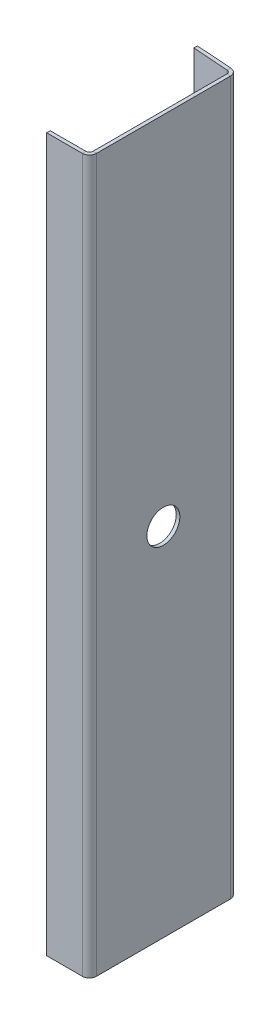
ISO-10303-21;
HEADER;
FILE_DESCRIPTION(('STEP AP214'),'2;1');
FILE_NAME('part.step','',(''),(''),'','','');
FILE_SCHEMA(('AUTOMOTIVE_DESIGN { 1 0 10303 214 1 1 1 1 }'));
ENDSEC;
DATA;
#1=APPLICATION_CONTEXT('core data for automotive mechanical design processes');
#2=APPLICATION_PROTOCOL_DEFINITION('international standard','automotive_design',2000,#1);
#3=PRODUCT_CONTEXT('',#1,'mechanical');
#4=PRODUCT('Part','Part','',(#3));
#5=PRODUCT_RELATED_PRODUCT_CATEGORY('part','',(#4));
#6=PRODUCT_DEFINITION_FORMATION('','',#4);
#7=PRODUCT_DEFINITION_CONTEXT('part definition',#1,'design');
#8=PRODUCT_DEFINITION('design','',#6,#7);
#9=PRODUCT_DEFINITION_SHAPE('','',#8);
#10=(LENGTH_UNIT() NAMED_UNIT(*) SI_UNIT(.MILLI.,.METRE.));
#11=(NAMED_UNIT(*) PLANE_ANGLE_UNIT() SI_UNIT($,.RADIAN.));
#12=(NAMED_UNIT(*) SI_UNIT($,.STERADIAN.) SOLID_ANGLE_UNIT());
#13=UNCERTAINTY_MEASURE_WITH_UNIT(LENGTH_MEASURE(1.E-05),#10,'distance_accuracy_value','');
#14=(GEOMETRIC_REPRESENTATION_CONTEXT(3) GLOBAL_UNCERTAINTY_ASSIGNED_CONTEXT((#13)) GLOBAL_UNIT_ASSIGNED_CONTEXT((#10,
#11,#12)) REPRESENTATION_CONTEXT('',''));
#15=CARTESIAN_POINT('',(0.,0.,0.));
#16=DIRECTION('',(0.,0.,1.));
#17=DIRECTION('',(1.,0.,0.));
#18=AXIS2_PLACEMENT_3D('',#15,#16,#17);
#19=CARTESIAN_POINT('',(0.,1270.,-6.35));
#20=DIRECTION('',(0.,1.,0.));
#21=DIRECTION('',(0.,0.,1.));
#22=AXIS2_PLACEMENT_3D('',#19,#20,#21);
#23=PLANE('',#22);
#24=DIRECTION('',(1.,0.,0.));
#25=VECTOR('',#24,1.);
#26=CARTESIAN_POINT('',(0.,1270.,-6.35));
#27=LINE('',#26,#25);
#28=CARTESIAN_POINT('',(0.,1270.,-6.35));
#29=VERTEX_POINT('',#28);
#30=CARTESIAN_POINT('',(6.35,1270.,-6.35));
#31=VERTEX_POINT('',#30);
#32=EDGE_CURVE('E11',#29,#31,#27,.T.);
#33=ORIENTED_EDGE('',*,*,#32,.F.);
#34=CARTESIAN_POINT('',(-6.35,1270.,-6.35));
#35=DIRECTION('',(0.,-1.,0.));
#36=DIRECTION('',(0.,0.,-1.));
#37=AXIS2_PLACEMENT_3D('',#34,#35,#36);
#38=CIRCLE('',#37,6.35);
#39=CARTESIAN_POINT('',(-6.34999999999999,1270.,0.));
#40=VERTEX_POINT('',#39);
#41=EDGE_CURVE('E249',#40,#29,#38,.F.);
#42=ORIENTED_EDGE('',*,*,#41,.F.);
#43=DIRECTION('',(0.,0.,-1.));
#44=VECTOR('',#43,1.);
#45=CARTESIAN_POINT('',(-6.35,1270.,6.35));
#46=LINE('',#45,#44);
#47=CARTESIAN_POINT('',(-6.35,1270.,6.35));
#48=VERTEX_POINT('',#47);
#49=EDGE_CURVE('E46',#48,#40,#46,.T.);
#50=ORIENTED_EDGE('',*,*,#49,.F.);
#51=CARTESIAN_POINT('',(-6.35,1270.,-6.35));
#52=DIRECTION('',(0.,1.,0.));
#53=DIRECTION('',(1.,0.,0.));
#54=AXIS2_PLACEMENT_3D('',#51,#52,#53);
#55=CIRCLE('',#54,12.7);
#56=EDGE_CURVE('E147',#48,#31,#55,.T.);
#57=ORIENTED_EDGE('',*,*,#56,.T.);
#58=EDGE_LOOP('',(#33,#42,#50,#57));
#59=FACE_BOUND('',#58,.T.);
#60=ADVANCED_FACE('F38',(#59),#23,.T.);
#61=CARTESIAN_POINT('',(-6.35,1270.,6.35));
#62=DIRECTION('',(0.,1.,0.));
#63=DIRECTION('',(0.,0.,1.));
#64=AXIS2_PLACEMENT_3D('',#61,#62,#63);
#65=PLANE('',#64);
#66=DIRECTION('',(0.,0.,-1.));
#67=VECTOR('',#66,1.);
#68=CARTESIAN_POINT('',(0.,1270.,0.));
#69=LINE('',#68,#67);
#70=CARTESIAN_POINT('',(0.,1270.,-244.903529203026));
#71=VERTEX_POINT('',#70);
#72=EDGE_CURVE('E141',#29,#71,#69,.T.);
#73=ORIENTED_EDGE('',*,*,#72,.F.);
#74=ORIENTED_EDGE('',*,*,#32,.T.);
#75=DIRECTION('',(0.,0.,-1.));
#76=VECTOR('',#75,1.);
#77=CARTESIAN_POINT('',(6.35,1270.,0.));
#78=LINE('',#77,#76);
#79=CARTESIAN_POINT('',(6.35,1270.,-244.903529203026));
#80=VERTEX_POINT('',#79);
#81=EDGE_CURVE('E138',#31,#80,#78,.T.);
#82=ORIENTED_EDGE('',*,*,#81,.T.);
#83=DIRECTION('',(-1.,0.,0.));
#84=VECTOR('',#83,1.);
#85=CARTESIAN_POINT('',(6.35,1270.,-244.903529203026));
#86=LINE('',#85,#84);
#87=EDGE_CURVE('E230',#80,#71,#86,.T.);
#88=ORIENTED_EDGE('',*,*,#87,.T.);
#89=EDGE_LOOP('',(#73,#74,#82,#88));
#90=FACE_BOUND('',#89,.T.);
#91=ADVANCED_FACE('F136',(#90),#65,.T.);
#92=CARTESIAN_POINT('',(-6.34999999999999,0.,0.));
#93=DIRECTION('',(0.,-1.,0.));
#94=DIRECTION('',(0.,0.,-1.));
#95=AXIS2_PLACEMENT_3D('',#92,#93,#94);
#96=PLANE('',#95);
#97=DIRECTION('',(0.,0.,1.));
#98=VECTOR('',#97,1.);
#99=CARTESIAN_POINT('',(-6.34999999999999,0.,0.));
#100=LINE('',#99,#98);
#101=CARTESIAN_POINT('',(-6.34999999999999,0.,0.));
#102=VERTEX_POINT('',#101);
#103=CARTESIAN_POINT('',(-6.35,0.,6.35));
#104=VERTEX_POINT('',#103);
#105=EDGE_CURVE('E235',#102,#104,#100,.T.);
#106=ORIENTED_EDGE('',*,*,#105,.F.);
#107=CARTESIAN_POINT('',(-6.35,0.,-6.35));
#108=DIRECTION('',(0.,-1.,0.));
#109=DIRECTION('',(0.,0.,-1.));
#110=AXIS2_PLACEMENT_3D('',#107,#108,#109);
#111=CIRCLE('',#110,6.35);
#112=CARTESIAN_POINT('',(0.,0.,-6.35));
#113=VERTEX_POINT('',#112);
#114=EDGE_CURVE('E187',#102,#113,#111,.F.);
#115=ORIENTED_EDGE('',*,*,#114,.T.);
#116=DIRECTION('',(-1.,0.,0.));
#117=VECTOR('',#116,1.);
#118=CARTESIAN_POINT('',(6.35,0.,-6.35));
#119=LINE('',#118,#117);
#120=CARTESIAN_POINT('',(6.35,0.,-6.35));
#121=VERTEX_POINT('',#120);
#122=EDGE_CURVE('E233',#121,#113,#119,.T.);
#123=ORIENTED_EDGE('',*,*,#122,.F.);
#124=CARTESIAN_POINT('',(-6.35,0.,-6.35));
#125=DIRECTION('',(0.,1.,0.));
#126=DIRECTION('',(1.,0.,0.));
#127=AXIS2_PLACEMENT_3D('',#124,#125,#126);
#128=CIRCLE('',#127,12.7);
#129=EDGE_CURVE('E159',#104,#121,#128,.T.);
#130=ORIENTED_EDGE('',*,*,#129,.F.);
#131=EDGE_LOOP('',(#106,#115,#123,#130));
#132=FACE_BOUND('',#131,.T.);
#133=ADVANCED_FACE('F292',(#132),#96,.T.);
#134=CARTESIAN_POINT('',(6.35,0.,-6.35));
#135=DIRECTION('',(0.,-1.,0.));
#136=DIRECTION('',(0.,0.,-1.));
#137=AXIS2_PLACEMENT_3D('',#134,#135,#136);
#138=PLANE('',#137);
#139=DIRECTION('',(1.,0.,0.));
#140=VECTOR('',#139,1.);
#141=CARTESIAN_POINT('',(-69.85,0.,0.));
#142=LINE('',#141,#140);
#143=CARTESIAN_POINT('',(-69.85,0.,0.));
#144=VERTEX_POINT('',#143);
#145=EDGE_CURVE('E190',#144,#102,#142,.T.);
#146=ORIENTED_EDGE('',*,*,#145,.T.);
#147=ORIENTED_EDGE('',*,*,#105,.T.);
#148=DIRECTION('',(1.,0.,0.));
#149=VECTOR('',#148,1.);
#150=CARTESIAN_POINT('',(-69.85,0.,6.35));
#151=LINE('',#150,#149);
#152=CARTESIAN_POINT('',(-69.85,0.,6.35));
#153=VERTEX_POINT('',#152);
#154=EDGE_CURVE('E196',#153,#104,#151,.T.);
#155=ORIENTED_EDGE('',*,*,#154,.F.);
#156=DIRECTION('',(0.,0.,-1.));
#157=VECTOR('',#156,1.);
#158=CARTESIAN_POINT('',(-69.85,0.,6.35));
#159=LINE('',#158,#157);
#160=EDGE_CURVE('E193',#153,#144,#159,.T.);
#161=ORIENTED_EDGE('',*,*,#160,.T.);
#162=EDGE_LOOP('',(#146,#147,#155,#161));
#163=FACE_BOUND('',#162,.T.);
#164=ADVANCED_FACE('F296',(#163),#138,.T.);
#165=CARTESIAN_POINT('',(-5.90704639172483,1270.,-251.238060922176));
#166=DIRECTION('',(0.,1.,0.));
#167=DIRECTION('',(0.,0.,1.));
#168=AXIS2_PLACEMENT_3D('',#165,#166,#167);
#169=PLANE('',#168);
#170=DIRECTION('',(0.0697564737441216,0.,-0.997564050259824));
#171=VECTOR('',#170,1.);
#172=CARTESIAN_POINT('',(-5.90704639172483,1270.,-251.238060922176));
#173=LINE('',#172,#171);
#174=CARTESIAN_POINT('',(-5.90704639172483,1270.,-251.238060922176));
#175=VERTEX_POINT('',#174);
#176=CARTESIAN_POINT('',(-5.46409278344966,1270.,-257.572592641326));
#177=VERTEX_POINT('',#176);
#178=EDGE_CURVE('E54',#175,#177,#173,.T.);
#179=ORIENTED_EDGE('',*,*,#178,.F.);
#180=CARTESIAN_POINT('',(-6.35,1270.,-244.903529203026));
#181=DIRECTION('',(0.,-1.,0.));
#182=DIRECTION('',(0.,0.,-1.));
#183=AXIS2_PLACEMENT_3D('',#180,#181,#182);
#184=CIRCLE('',#183,6.35);
#185=EDGE_CURVE('E259',#71,#175,#184,.F.);
#186=ORIENTED_EDGE('',*,*,#185,.F.);
#187=ORIENTED_EDGE('',*,*,#87,.F.);
#188=CARTESIAN_POINT('',(-6.35,1270.,-244.903529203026));
#189=DIRECTION('',(0.,1.,0.));
#190=DIRECTION('',(1.,0.,0.));
#191=AXIS2_PLACEMENT_3D('',#188,#189,#190);
#192=CIRCLE('',#191,12.7);
#193=EDGE_CURVE('E167',#80,#177,#192,.T.);
#194=ORIENTED_EDGE('',*,*,#193,.T.);
#195=EDGE_LOOP('',(#179,#186,#187,#194));
#196=FACE_BOUND('',#195,.T.);
#197=ADVANCED_FACE('F302',(#196),#169,.T.);
#198=CARTESIAN_POINT('',(6.35,1270.,-244.903529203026));
#199=DIRECTION('',(0.,1.,0.));
#200=DIRECTION('',(0.,0.,1.));
#201=AXIS2_PLACEMENT_3D('',#198,#199,#200);
#202=PLANE('',#201);
#203=DIRECTION('',(-0.997564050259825,0.,-0.0697564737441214));
#204=VECTOR('',#203,1.);
#205=CARTESIAN_POINT('',(0.,1270.,-250.825));
#206=LINE('',#205,#204);
#207=CARTESIAN_POINT('',(-69.6798489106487,1270.,-255.697489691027));
#208=VERTEX_POINT('',#207);
#209=EDGE_CURVE('E262',#175,#208,#206,.T.);
#210=ORIENTED_EDGE('',*,*,#209,.F.);
#211=ORIENTED_EDGE('',*,*,#178,.T.);
#212=DIRECTION('',(-0.997564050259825,0.,-0.0697564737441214));
#213=VECTOR('',#212,1.);
#214=CARTESIAN_POINT('',(0.442953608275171,1270.,-257.15953171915));
#215=LINE('',#214,#213);
#216=CARTESIAN_POINT('',(-69.2368953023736,1270.,-262.032021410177));
#217=VERTEX_POINT('',#216);
#218=EDGE_CURVE('E108',#177,#217,#215,.T.);
#219=ORIENTED_EDGE('',*,*,#218,.T.);
#220=DIRECTION('',(0.0697564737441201,0.,-0.997564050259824));
#221=VECTOR('',#220,1.);
#222=CARTESIAN_POINT('',(-69.6798489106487,1270.,-255.697489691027));
#223=LINE('',#222,#221);
#224=EDGE_CURVE('E265',#208,#217,#223,.T.);
#225=ORIENTED_EDGE('',*,*,#224,.F.);
#226=EDGE_LOOP('',(#210,#211,#219,#225));
#227=FACE_BOUND('',#226,.T.);
#228=ADVANCED_FACE('F306',(#227),#202,.T.);
#229=CARTESIAN_POINT('',(0.,0.,-244.903529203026));
#230=DIRECTION('',(0.,-1.,0.));
#231=DIRECTION('',(0.,0.,-1.));
#232=AXIS2_PLACEMENT_3D('',#229,#230,#231);
#233=PLANE('',#232);
#234=DIRECTION('',(1.,0.,0.));
#235=VECTOR('',#234,1.);
#236=CARTESIAN_POINT('',(0.,0.,-244.903529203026));
#237=LINE('',#236,#235);
#238=CARTESIAN_POINT('',(0.,0.,-244.903529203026));
#239=VERTEX_POINT('',#238);
#240=CARTESIAN_POINT('',(6.35,0.,-244.903529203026));
#241=VERTEX_POINT('',#240);
#242=EDGE_CURVE('E95',#239,#241,#237,.T.);
#243=ORIENTED_EDGE('',*,*,#242,.F.);
#244=CARTESIAN_POINT('',(-6.35,0.,-244.903529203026));
#245=DIRECTION('',(0.,-1.,0.));
#246=DIRECTION('',(0.,0.,-1.));
#247=AXIS2_PLACEMENT_3D('',#244,#245,#246);
#248=CIRCLE('',#247,6.35);
#249=CARTESIAN_POINT('',(-5.90704639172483,0.,-251.238060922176));
#250=VERTEX_POINT('',#249);
#251=EDGE_CURVE('E183',#239,#250,#248,.F.);
#252=ORIENTED_EDGE('',*,*,#251,.T.);
#253=DIRECTION('',(-0.0697564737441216,0.,0.997564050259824));
#254=VECTOR('',#253,1.);
#255=CARTESIAN_POINT('',(-5.46409278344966,0.,-257.572592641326));
#256=LINE('',#255,#254);
#257=CARTESIAN_POINT('',(-5.46409278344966,0.,-257.572592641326));
#258=VERTEX_POINT('',#257);
#259=EDGE_CURVE('E102',#258,#250,#256,.T.);
#260=ORIENTED_EDGE('',*,*,#259,.F.);
#261=CARTESIAN_POINT('',(-6.35,0.,-244.903529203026));
#262=DIRECTION('',(0.,1.,0.));
#263=DIRECTION('',(1.,0.,0.));
#264=AXIS2_PLACEMENT_3D('',#261,#262,#263);
#265=CIRCLE('',#264,12.7);
#266=EDGE_CURVE('E202',#241,#258,#265,.T.);
#267=ORIENTED_EDGE('',*,*,#266,.F.);
#268=EDGE_LOOP('',(#243,#252,#260,#267));
#269=FACE_BOUND('',#268,.T.);
#270=ADVANCED_FACE('F310',(#269),#233,.T.);
#271=CARTESIAN_POINT('',(-5.46409278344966,0.,-257.572592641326));
#272=DIRECTION('',(0.,-1.,0.));
#273=DIRECTION('',(0.,0.,-1.));
#274=AXIS2_PLACEMENT_3D('',#271,#272,#273);
#275=PLANE('',#274);
#276=DIRECTION('',(0.,0.,-1.));
#277=VECTOR('',#276,1.);
#278=CARTESIAN_POINT('',(0.,0.,0.));
#279=LINE('',#278,#277);
#280=EDGE_CURVE('E185',#113,#239,#279,.T.);
#281=ORIENTED_EDGE('',*,*,#280,.T.);
#282=ORIENTED_EDGE('',*,*,#242,.T.);
#283=DIRECTION('',(0.,0.,-1.));
#284=VECTOR('',#283,1.);
#285=CARTESIAN_POINT('',(6.35,0.,0.));
#286=LINE('',#285,#284);
#287=EDGE_CURVE('E200',#121,#241,#286,.T.);
#288=ORIENTED_EDGE('',*,*,#287,.F.);
#289=ORIENTED_EDGE('',*,*,#122,.T.);
#290=EDGE_LOOP('',(#281,#282,#288,#289));
#291=FACE_BOUND('',#290,.T.);
#292=ADVANCED_FACE('F313',(#291),#275,.T.);
#293=CARTESIAN_POINT('',(0.442953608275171,1270.,-257.15953171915));
#294=DIRECTION('',(-0.0697564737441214,0.,0.997564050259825));
#295=DIRECTION('',(0.997564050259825,0.,0.0697564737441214));
#296=AXIS2_PLACEMENT_3D('',#293,#294,#295);
#297=PLANE('',#296);
#298=DIRECTION('',(-0.997564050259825,0.,-0.0697564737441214));
#299=VECTOR('',#298,1.);
#300=CARTESIAN_POINT('',(0.442953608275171,0.,-257.15953171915));
#301=LINE('',#300,#299);
#302=CARTESIAN_POINT('',(-69.2368953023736,0.,-262.032021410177));
#303=VERTEX_POINT('',#302);
#304=EDGE_CURVE('E173',#258,#303,#301,.T.);
#305=ORIENTED_EDGE('',*,*,#304,.T.);
#306=DIRECTION('',(0.,-1.,0.));
#307=VECTOR('',#306,1.);
#308=CARTESIAN_POINT('',(-69.2368953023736,1270.,-262.032021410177));
#309=LINE('',#308,#307);
#310=EDGE_CURVE('E226',#217,#303,#309,.T.);
#311=ORIENTED_EDGE('',*,*,#310,.F.);
#312=ORIENTED_EDGE('',*,*,#218,.F.);
#313=DIRECTION('',(0.,-1.,0.));
#314=VECTOR('',#313,1.);
#315=CARTESIAN_POINT('',(-5.46409278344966,1270.,-257.572592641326));
#316=LINE('',#315,#314);
#317=EDGE_CURVE('E169',#177,#258,#316,.T.);
#318=ORIENTED_EDGE('',*,*,#317,.T.);
#319=EDGE_LOOP('',(#305,#311,#312,#318));
#320=FACE_BOUND('',#319,.T.);
#321=ADVANCED_FACE('F316',(#320),#297,.F.);
#322=CARTESIAN_POINT('',(-69.6798489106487,1270.,-255.697489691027));
#323=DIRECTION('',(-0.997564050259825,0.,-0.0697564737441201));
#324=DIRECTION('',(-0.0697564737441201,0.,0.997564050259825));
#325=AXIS2_PLACEMENT_3D('',#322,#323,#324);
#326=PLANE('',#325);
#327=DIRECTION('',(0.0697564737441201,0.,-0.997564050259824));
#328=VECTOR('',#327,1.);
#329=CARTESIAN_POINT('',(-69.6798489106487,0.,-255.697489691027));
#330=LINE('',#329,#328);
#331=CARTESIAN_POINT('',(-69.6798489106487,0.,-255.697489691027));
#332=VERTEX_POINT('',#331);
#333=EDGE_CURVE('E176',#332,#303,#330,.T.);
#334=ORIENTED_EDGE('',*,*,#333,.F.);
#335=DIRECTION('',(0.,-1.,0.));
#336=VECTOR('',#335,1.);
#337=CARTESIAN_POINT('',(-69.6798489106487,1270.,-255.697489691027));
#338=LINE('',#337,#336);
#339=EDGE_CURVE('E224',#208,#332,#338,.T.);
#340=ORIENTED_EDGE('',*,*,#339,.F.);
#341=ORIENTED_EDGE('',*,*,#224,.T.);
#342=ORIENTED_EDGE('',*,*,#310,.T.);
#343=EDGE_LOOP('',(#334,#340,#341,#342));
#344=FACE_BOUND('',#343,.T.);
#345=ADVANCED_FACE('F319',(#344),#326,.T.);
#346=CARTESIAN_POINT('',(0.,1270.,-250.825));
#347=DIRECTION('',(-0.0697564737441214,0.,0.997564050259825));
#348=DIRECTION('',(0.997564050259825,0.,0.0697564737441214));
#349=AXIS2_PLACEMENT_3D('',#346,#347,#348);
#350=PLANE('',#349);
#351=DIRECTION('',(-0.997564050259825,0.,-0.0697564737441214));
#352=VECTOR('',#351,1.);
#353=CARTESIAN_POINT('',(0.,0.,-250.825));
#354=LINE('',#353,#352);
#355=EDGE_CURVE('E180',#250,#332,#354,.T.);
#356=ORIENTED_EDGE('',*,*,#355,.F.);
#357=DIRECTION('',(0.,-1.,0.));
#358=VECTOR('',#357,1.);
#359=CARTESIAN_POINT('',(-5.90704639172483,1270.,-251.238060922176));
#360=LINE('',#359,#358);
#361=EDGE_CURVE('E221',#175,#250,#360,.T.);
#362=ORIENTED_EDGE('',*,*,#361,.F.);
#363=ORIENTED_EDGE('',*,*,#209,.T.);
#364=ORIENTED_EDGE('',*,*,#339,.T.);
#365=EDGE_LOOP('',(#356,#362,#363,#364));
#366=FACE_BOUND('',#365,.T.);
#367=ADVANCED_FACE('F323',(#366),#350,.T.);
#368=CARTESIAN_POINT('',(-6.35,1270.,-244.903529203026));
#369=DIRECTION('',(0.,-1.,0.));
#370=DIRECTION('',(0.,0.,-1.));
#371=AXIS2_PLACEMENT_3D('',#368,#369,#370);
#372=CYLINDRICAL_SURFACE('',#371,6.35);
#373=ORIENTED_EDGE('',*,*,#251,.F.);
#374=DIRECTION('',(0.,-1.,0.));
#375=VECTOR('',#374,1.);
#376=CARTESIAN_POINT('',(0.,1270.,-244.903529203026));
#377=LINE('',#376,#375);
#378=EDGE_CURVE('E218',#71,#239,#377,.T.);
#379=ORIENTED_EDGE('',*,*,#378,.F.);
#380=ORIENTED_EDGE('',*,*,#185,.T.);
#381=ORIENTED_EDGE('',*,*,#361,.T.);
#382=EDGE_LOOP('',(#373,#379,#380,#381));
#383=FACE_BOUND('',#382,.T.);
#384=ADVANCED_FACE('F327',(#383),#372,.F.);
#385=CARTESIAN_POINT('',(0.,1270.,0.));
#386=DIRECTION('',(-1.,0.,0.));
#387=DIRECTION('',(0.,0.,1.));
#388=AXIS2_PLACEMENT_3D('',#385,#386,#387);
#389=PLANE('',#388);
#390=CARTESIAN_POINT('',(0.,635.,-125.4125));
#391=DIRECTION('',(-1.,0.,0.));
#392=DIRECTION('',(0.,0.,1.));
#393=AXIS2_PLACEMENT_3D('',#390,#391,#392);
#394=CIRCLE('',#393,29.36875);
#395=CARTESIAN_POINT('',(0.,635.,-96.04375));
#396=VERTEX_POINT('',#395);
#397=EDGE_CURVE('E177',#396,#396,#394,.T.);
#398=ORIENTED_EDGE('',*,*,#397,.F.);
#399=EDGE_LOOP('',(#398));
#400=FACE_BOUND('',#399,.T.);
#401=ORIENTED_EDGE('',*,*,#280,.F.);
#402=DIRECTION('',(0.,-1.,0.));
#403=VECTOR('',#402,1.);
#404=CARTESIAN_POINT('',(0.,1270.,-6.35));
#405=LINE('',#404,#403);
#406=EDGE_CURVE('E215',#29,#113,#405,.T.);
#407=ORIENTED_EDGE('',*,*,#406,.F.);
#408=ORIENTED_EDGE('',*,*,#72,.T.);
#409=ORIENTED_EDGE('',*,*,#378,.T.);
#410=EDGE_LOOP('',(#401,#407,#408,#409));
#411=FACE_BOUND('',#410,.T.);
#412=ADVANCED_FACE('F331',(#400,#411),#389,.T.);
#413=CARTESIAN_POINT('',(-6.35,1270.,-6.35));
#414=DIRECTION('',(0.,-1.,0.));
#415=DIRECTION('',(0.,0.,-1.));
#416=AXIS2_PLACEMENT_3D('',#413,#414,#415);
#417=CYLINDRICAL_SURFACE('',#416,6.35);
#418=ORIENTED_EDGE('',*,*,#114,.F.);
#419=DIRECTION('',(0.,-1.,0.));
#420=VECTOR('',#419,1.);
#421=CARTESIAN_POINT('',(-6.34999999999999,1270.,0.));
#422=LINE('',#421,#420);
#423=EDGE_CURVE('E212',#40,#102,#422,.T.);
#424=ORIENTED_EDGE('',*,*,#423,.F.);
#425=ORIENTED_EDGE('',*,*,#41,.T.);
#426=ORIENTED_EDGE('',*,*,#406,.T.);
#427=EDGE_LOOP('',(#418,#424,#425,#426));
#428=FACE_BOUND('',#427,.T.);
#429=ADVANCED_FACE('F248',(#428),#417,.F.);
#430=CARTESIAN_POINT('',(-69.85,1270.,0.));
#431=DIRECTION('',(0.,0.,-1.));
#432=DIRECTION('',(-1.,0.,0.));
#433=AXIS2_PLACEMENT_3D('',#430,#431,#432);
#434=PLANE('',#433);
#435=ORIENTED_EDGE('',*,*,#145,.F.);
#436=DIRECTION('',(0.,-1.,0.));
#437=VECTOR('',#436,1.);
#438=CARTESIAN_POINT('',(-69.85,1270.,0.));
#439=LINE('',#438,#437);
#440=CARTESIAN_POINT('',(-69.85,1270.,0.));
#441=VERTEX_POINT('',#440);
#442=EDGE_CURVE('E210',#441,#144,#439,.T.);
#443=ORIENTED_EDGE('',*,*,#442,.F.);
#444=DIRECTION('',(1.,0.,0.));
#445=VECTOR('',#444,1.);
#446=CARTESIAN_POINT('',(-69.85,1270.,0.));
#447=LINE('',#446,#445);
#448=EDGE_CURVE('E242',#441,#40,#447,.T.);
#449=ORIENTED_EDGE('',*,*,#448,.T.);
#450=ORIENTED_EDGE('',*,*,#423,.T.);
#451=EDGE_LOOP('',(#435,#443,#449,#450));
#452=FACE_BOUND('',#451,.T.);
#453=ADVANCED_FACE('F253',(#452),#434,.T.);
#454=CARTESIAN_POINT('',(-69.85,1270.,6.35));
#455=DIRECTION('',(-1.,0.,0.));
#456=DIRECTION('',(0.,0.,1.));
#457=AXIS2_PLACEMENT_3D('',#454,#455,#456);
#458=PLANE('',#457);
#459=ORIENTED_EDGE('',*,*,#160,.F.);
#460=DIRECTION('',(0.,-1.,0.));
#461=VECTOR('',#460,1.);
#462=CARTESIAN_POINT('',(-69.85,1270.,6.35));
#463=LINE('',#462,#461);
#464=CARTESIAN_POINT('',(-69.85,1270.,6.35));
#465=VERTEX_POINT('',#464);
#466=EDGE_CURVE('E208',#465,#153,#463,.T.);
#467=ORIENTED_EDGE('',*,*,#466,.F.);
#468=DIRECTION('',(0.,0.,-1.));
#469=VECTOR('',#468,1.);
#470=CARTESIAN_POINT('',(-69.85,1270.,6.35));
#471=LINE('',#470,#469);
#472=EDGE_CURVE('E254',#465,#441,#471,.T.);
#473=ORIENTED_EDGE('',*,*,#472,.T.);
#474=ORIENTED_EDGE('',*,*,#442,.T.);
#475=EDGE_LOOP('',(#459,#467,#473,#474));
#476=FACE_BOUND('',#475,.T.);
#477=ADVANCED_FACE('F340',(#476),#458,.T.);
#478=CARTESIAN_POINT('',(-69.85,1270.,6.35));
#479=DIRECTION('',(0.,0.,-1.));
#480=DIRECTION('',(-1.,0.,0.));
#481=AXIS2_PLACEMENT_3D('',#478,#479,#480);
#482=PLANE('',#481);
#483=ORIENTED_EDGE('',*,*,#154,.T.);
#484=DIRECTION('',(0.,-1.,0.));
#485=VECTOR('',#484,1.);
#486=CARTESIAN_POINT('',(-6.35,1270.,6.35));
#487=LINE('',#486,#485);
#488=EDGE_CURVE('E161',#48,#104,#487,.T.);
#489=ORIENTED_EDGE('',*,*,#488,.F.);
#490=DIRECTION('',(1.,0.,0.));
#491=VECTOR('',#490,1.);
#492=CARTESIAN_POINT('',(-69.85,1270.,6.35));
#493=LINE('',#492,#491);
#494=EDGE_CURVE('E152',#465,#48,#493,.T.);
#495=ORIENTED_EDGE('',*,*,#494,.F.);
#496=ORIENTED_EDGE('',*,*,#466,.T.);
#497=EDGE_LOOP('',(#483,#489,#495,#496));
#498=FACE_BOUND('',#497,.T.);
#499=ADVANCED_FACE('F286',(#498),#482,.F.);
#500=CARTESIAN_POINT('',(-6.35,1270.,-6.35));
#501=DIRECTION('',(0.,-1.,0.));
#502=DIRECTION('',(0.,0.,-1.));
#503=AXIS2_PLACEMENT_3D('',#500,#501,#502);
#504=CYLINDRICAL_SURFACE('',#503,12.7);
#505=ORIENTED_EDGE('',*,*,#129,.T.);
#506=DIRECTION('',(0.,-1.,0.));
#507=VECTOR('',#506,1.);
#508=CARTESIAN_POINT('',(6.35,1270.,-6.35));
#509=LINE('',#508,#507);
#510=EDGE_CURVE('E156',#31,#121,#509,.T.);
#511=ORIENTED_EDGE('',*,*,#510,.F.);
#512=ORIENTED_EDGE('',*,*,#56,.F.);
#513=ORIENTED_EDGE('',*,*,#488,.T.);
#514=EDGE_LOOP('',(#505,#511,#512,#513));
#515=FACE_BOUND('',#514,.T.);
#516=ADVANCED_FACE('F157',(#515),#504,.T.);
#517=CARTESIAN_POINT('',(6.35,1270.,0.));
#518=DIRECTION('',(-1.,0.,0.));
#519=DIRECTION('',(0.,0.,1.));
#520=AXIS2_PLACEMENT_3D('',#517,#518,#519);
#521=PLANE('',#520);
#522=CARTESIAN_POINT('',(6.35,635.,-125.4125));
#523=DIRECTION('',(1.,0.,0.));
#524=DIRECTION('',(0.,0.,-1.));
#525=AXIS2_PLACEMENT_3D('',#522,#523,#524);
#526=CIRCLE('',#525,29.36875);
#527=CARTESIAN_POINT('',(6.35,635.,-154.78125));
#528=VERTEX_POINT('',#527);
#529=EDGE_CURVE('E271',#528,#528,#526,.T.);
#530=ORIENTED_EDGE('',*,*,#529,.F.);
#531=EDGE_LOOP('',(#530));
#532=FACE_BOUND('',#531,.T.);
#533=ORIENTED_EDGE('',*,*,#287,.T.);
#534=DIRECTION('',(0.,-1.,0.));
#535=VECTOR('',#534,1.);
#536=CARTESIAN_POINT('',(6.35,1270.,-244.903529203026));
#537=LINE('',#536,#535);
#538=EDGE_CURVE('E162',#80,#241,#537,.T.);
#539=ORIENTED_EDGE('',*,*,#538,.F.);
#540=ORIENTED_EDGE('',*,*,#81,.F.);
#541=ORIENTED_EDGE('',*,*,#510,.T.);
#542=EDGE_LOOP('',(#533,#539,#540,#541));
#543=FACE_BOUND('',#542,.T.);
#544=ADVANCED_FACE('F164',(#532,#543),#521,.F.);
#545=CARTESIAN_POINT('',(-6.35,1270.,-244.903529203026));
#546=DIRECTION('',(0.,-1.,0.));
#547=DIRECTION('',(0.,0.,-1.));
#548=AXIS2_PLACEMENT_3D('',#545,#546,#547);
#549=CYLINDRICAL_SURFACE('',#548,12.7);
#550=ORIENTED_EDGE('',*,*,#266,.T.);
#551=ORIENTED_EDGE('',*,*,#317,.F.);
#552=ORIENTED_EDGE('',*,*,#193,.F.);
#553=ORIENTED_EDGE('',*,*,#538,.T.);
#554=EDGE_LOOP('',(#550,#551,#552,#553));
#555=FACE_BOUND('',#554,.T.);
#556=ADVANCED_FACE('F278',(#555),#549,.T.);
#557=CARTESIAN_POINT('',(-6.35,1270.,-244.903529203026));
#558=DIRECTION('',(0.,-1.,0.));
#559=DIRECTION('',(-1.,0.,0.));
#560=AXIS2_PLACEMENT_3D('',#557,#558,#559);
#561=PLANE('',#560);
#562=ORIENTED_EDGE('',*,*,#494,.T.);
#563=ORIENTED_EDGE('',*,*,#49,.T.);
#564=ORIENTED_EDGE('',*,*,#448,.F.);
#565=ORIENTED_EDGE('',*,*,#472,.F.);
#566=EDGE_LOOP('',(#562,#563,#564,#565));
#567=FACE_BOUND('',#566,.T.);
#568=ADVANCED_FACE('F239',(#567),#561,.F.);
#569=CARTESIAN_POINT('',(-6.35,0.,-244.903529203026));
#570=DIRECTION('',(0.,-1.,0.));
#571=DIRECTION('',(-1.,0.,0.));
#572=AXIS2_PLACEMENT_3D('',#569,#570,#571);
#573=PLANE('',#572);
#574=ORIENTED_EDGE('',*,*,#304,.F.);
#575=ORIENTED_EDGE('',*,*,#259,.T.);
#576=ORIENTED_EDGE('',*,*,#355,.T.);
#577=ORIENTED_EDGE('',*,*,#333,.T.);
#578=EDGE_LOOP('',(#574,#575,#576,#577));
#579=FACE_BOUND('',#578,.T.);
#580=ADVANCED_FACE('F360',(#579),#573,.T.);
#581=CARTESIAN_POINT('',(-69.85,635.,-125.4125));
#582=DIRECTION('',(1.,0.,0.));
#583=DIRECTION('',(0.,0.,-1.));
#584=AXIS2_PLACEMENT_3D('',#581,#582,#583);
#585=CYLINDRICAL_SURFACE('',#584,29.36875);
#586=ORIENTED_EDGE('',*,*,#397,.T.);
#587=EDGE_LOOP('',(#586));
#588=FACE_BOUND('',#587,.T.);
#589=ORIENTED_EDGE('',*,*,#529,.T.);
#590=EDGE_LOOP('',(#589));
#591=FACE_BOUND('',#590,.T.);
#592=ADVANCED_FACE('F275',(#588,#591),#585,.F.);
#593=CLOSED_SHELL('',(#60,#91,#133,#164,#197,#228,#270,#292,#321,#345,#367,#384,#412,#429,#453,
#477,#499,#516,#544,#556,#568,#580,#592));
#594=MANIFOLD_SOLID_BREP('B2',#593);
#595=ADVANCED_BREP_SHAPE_REPRESENTATION('',(#18,#594),#14);
#596=SHAPE_DEFINITION_REPRESENTATION(#9,#595);
ENDSEC;
END-ISO-10303-21;
